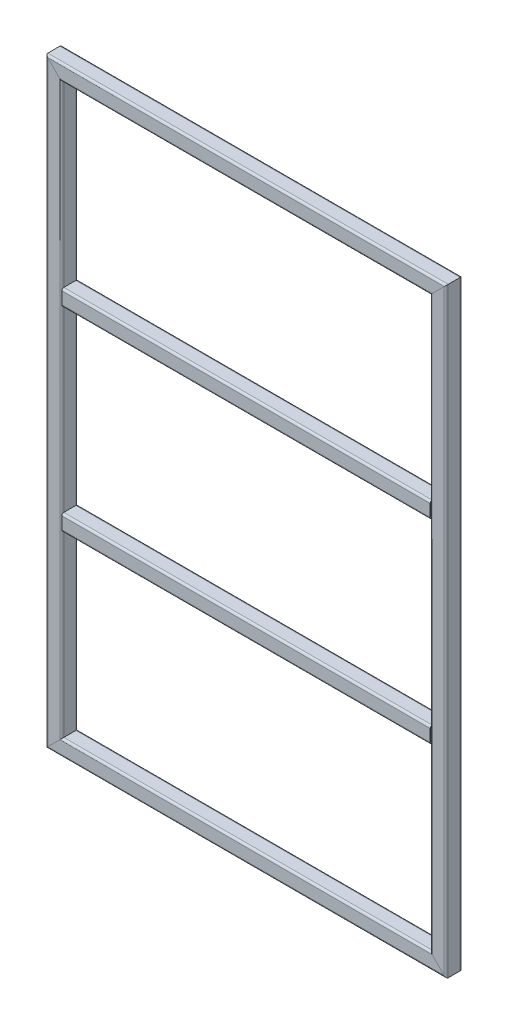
from build123d import *

# Parameters (mm, degrees)
CZ_ON_KONSTRUKCYJNY1_DEPTH      = 2977.568542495
CZ_ON_KONSTRUKCYJNY1_DEPTH_BACK = 57.568542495
CZ_ON_KONSTRUKCYJNY1_2_DEPTH    = 2035.13708499
CZ_ON_KONSTRUKCYJNY1_3_DEPTH    = 3035.13708499
CZ_ON_KONSTRUKCYJNY1_4_DEPTH    = 2035.13708499
CZ_ON_KONSTRUKCYJNY1_5_DEPTH    = 1922
CZ_ON_KONSTRUKCYJNY1_6_DEPTH    = 1922


with BuildPart() as part:
    # Sketch1 → Cz_on konstrukcyjny1 (new, two sides: drawn at the far end of the back side and taken through both)
    with BuildSketch(Plane(origin=(-960, -1460, 0), x_dir=(-1, 0, 0), z_dir=(0, 1, 0)).offset(-CZ_ON_KONSTRUKCYJNY1_DEPTH_BACK)):
        with BuildLine():
            Line((-30, -40), (30, -40))
            ThreePointArc((30, -40), (37.071067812, -37.071067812), (40, -30))
            Line((40, -30), (40, 30))
            ThreePointArc((40, 30), (37.071067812, 37.071067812), (30, 40))
            Line((30, 40), (-30, 40))
            ThreePointArc((-30, 40), (-37.071067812, 37.071067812), (-40, 30))
            Line((-40, 30), (-40, -30))
            ThreePointArc((-40, -30), (-37.071067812, -37.071067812), (-30, -40))
        make_face()
        with BuildLine():
            Line((-30, -35), (30, -35))
            ThreePointArc((30, -35), (33.535533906, -33.535533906), (35, -30))
            Line((35, -30), (35, 30))
            ThreePointArc((35, 30), (33.535533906, 33.535533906), (30, 35))
            Line((30, 35), (-30, 35))
            ThreePointArc((-30, 35), (-33.535533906, 33.535533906), (-35, 30))
            Line((-35, 30), (-35, -30))
            ThreePointArc((-35, -30), (-33.535533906, -33.535533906), (-30, -35))
        make_face(mode=Mode.SUBTRACT)
    extrude(amount=CZ_ON_KONSTRUKCYJNY1_DEPTH + CZ_ON_KONSTRUKCYJNY1_DEPTH_BACK)

    # Cz_on konstrukcyjny1 mitre 1
    split(bisect_by=Plane(origin=(-960, -1460, 0), x_dir=(-0.707106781, -0.707106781, 0), z_dir=(-0.707106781, 0.707106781, 0)), keep=Keep.TOP)

    # Cz_on konstrukcyjny1 mitre 2
    split(bisect_by=Plane(origin=(-960, 1460, 0), x_dir=(0.707106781, -0.707106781, 0), z_dir=(-0.707106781, -0.707106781, 0)), keep=Keep.TOP)


with BuildPart() as body_2:
    # Sketch1 on segment 2 (on carried to segment 2) → Cz_on konstrukcyjny1 2 (new body)
    with BuildSketch(Plane(origin=(-1017.568542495, 1460, 0), x_dir=(0, 1, 0), z_dir=(1, 0, 0))):
        with BuildLine():
            Line((-30, -40), (30, -40))
            ThreePointArc((30, -40), (37.071067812, -37.071067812), (40, -30))
            Line((40, -30), (40, 30))
            ThreePointArc((40, 30), (37.071067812, 37.071067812), (30, 40))
            Line((30, 40), (-30, 40))
            ThreePointArc((-30, 40), (-37.071067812, 37.071067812), (-40, 30))
            Line((-40, 30), (-40, -30))
            ThreePointArc((-40, -30), (-37.071067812, -37.071067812), (-30, -40))
        make_face()
        with BuildLine():
            Line((-30, -35), (30, -35))
            ThreePointArc((30, -35), (33.535533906, -33.535533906), (35, -30))
            Line((35, -30), (35, 30))
            ThreePointArc((35, 30), (33.535533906, 33.535533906), (30, 35))
            Line((30, 35), (-30, 35))
            ThreePointArc((-30, 35), (-33.535533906, 33.535533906), (-35, 30))
            Line((-35, 30), (-35, -30))
            ThreePointArc((-35, -30), (-33.535533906, -33.535533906), (-30, -35))
        make_face(mode=Mode.SUBTRACT)
    extrude(amount=CZ_ON_KONSTRUKCYJNY1_2_DEPTH)

    # Cz_on konstrukcyjny1 2 mitre 1
    split(bisect_by=Plane(origin=(960, 1460, 0), x_dir=(-0.707106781, -0.707106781, 0), z_dir=(-0.707106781, 0.707106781, 0)), keep=Keep.TOP)

    # Cz_on konstrukcyjny1 2 mitre 2
    split(bisect_by=Plane(origin=(-960, 1460, 0), x_dir=(-0.707106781, 0.707106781, 0), z_dir=(0.707106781, 0.707106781, 0)), keep=Keep.TOP)


with BuildPart() as body_3:
    # Sketch1 on segment 3 (on carried to segment 3) → Cz_on konstrukcyjny1 3 (new body)
    with BuildSketch(Plane(origin=(960, 1517.568542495, 0), x_dir=(1, 0, 0), z_dir=(0, -1, 0))):
        with BuildLine():
            Line((-30, -40), (30, -40))
            ThreePointArc((30, -40), (37.071067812, -37.071067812), (40, -30))
            Line((40, -30), (40, 30))
            ThreePointArc((40, 30), (37.071067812, 37.071067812), (30, 40))
            Line((30, 40), (-30, 40))
            ThreePointArc((-30, 40), (-37.071067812, 37.071067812), (-40, 30))
            Line((-40, 30), (-40, -30))
            ThreePointArc((-40, -30), (-37.071067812, -37.071067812), (-30, -40))
        make_face()
        with BuildLine():
            Line((-30, -35), (30, -35))
            ThreePointArc((30, -35), (33.535533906, -33.535533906), (35, -30))
            Line((35, -30), (35, 30))
            ThreePointArc((35, 30), (33.535533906, 33.535533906), (30, 35))
            Line((30, 35), (-30, 35))
            ThreePointArc((-30, 35), (-33.535533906, 33.535533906), (-35, 30))
            Line((-35, 30), (-35, -30))
            ThreePointArc((-35, -30), (-33.535533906, -33.535533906), (-30, -35))
        make_face(mode=Mode.SUBTRACT)
    extrude(amount=CZ_ON_KONSTRUKCYJNY1_3_DEPTH)

    # Cz_on konstrukcyjny1 3 mitre 1
    split(bisect_by=Plane(origin=(960, -1460, 0), x_dir=(-0.707106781, 0.707106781, 0), z_dir=(0.707106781, 0.707106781, 0)), keep=Keep.TOP)

    # Cz_on konstrukcyjny1 3 mitre 2
    split(bisect_by=Plane(origin=(960, 1460, 0), x_dir=(0.707106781, 0.707106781, 0), z_dir=(0.707106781, -0.707106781, 0)), keep=Keep.TOP)


with BuildPart() as body_4:
    # Sketch1 on segment 4 (on carried to segment 4) → Cz_on konstrukcyjny1 4 (new body)
    with BuildSketch(Plane(origin=(1017.568542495, -1460, 0), x_dir=(0, -1, 0), z_dir=(-1, 0, 0))):
        with BuildLine():
            Line((-30, -40), (30, -40))
            ThreePointArc((30, -40), (37.071067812, -37.071067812), (40, -30))
            Line((40, -30), (40, 30))
            ThreePointArc((40, 30), (37.071067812, 37.071067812), (30, 40))
            Line((30, 40), (-30, 40))
            ThreePointArc((-30, 40), (-37.071067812, 37.071067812), (-40, 30))
            Line((-40, 30), (-40, -30))
            ThreePointArc((-40, -30), (-37.071067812, -37.071067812), (-30, -40))
        make_face()
        with BuildLine():
            Line((-30, -35), (30, -35))
            ThreePointArc((30, -35), (33.535533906, -33.535533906), (35, -30))
            Line((35, -30), (35, 30))
            ThreePointArc((35, 30), (33.535533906, 33.535533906), (30, 35))
            Line((30, 35), (-30, 35))
            ThreePointArc((-30, 35), (-33.535533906, 33.535533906), (-35, 30))
            Line((-35, 30), (-35, -30))
            ThreePointArc((-35, -30), (-33.535533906, -33.535533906), (-30, -35))
        make_face(mode=Mode.SUBTRACT)
    extrude(amount=CZ_ON_KONSTRUKCYJNY1_4_DEPTH)

    # Cz_on konstrukcyjny1 4 mitre 1
    split(bisect_by=Plane(origin=(960, -1460, 0), x_dir=(0.707106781, -0.707106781, 0), z_dir=(-0.707106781, -0.707106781, 0)), keep=Keep.TOP)

    # Cz_on konstrukcyjny1 4 mitre 2
    split(bisect_by=Plane(origin=(-960, -1460, 0), x_dir=(0.707106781, 0.707106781, 0), z_dir=(0.707106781, -0.707106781, 0)), keep=Keep.TOP)


with BuildPart() as body_5:
    # Sketch1 on segment 5 (on carried to segment 5) → Cz_on konstrukcyjny1 5 (new body)
    with BuildSketch(Plane(origin=(-961, 486.666666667, 0), x_dir=(0, 1, 0), z_dir=(1, 0, 0))):
        with BuildLine():
            Line((-30, -40), (30, -40))
            ThreePointArc((30, -40), (37.071067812, -37.071067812), (40, -30))
            Line((40, -30), (40, 30))
            ThreePointArc((40, 30), (37.071067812, 37.071067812), (30, 40))
            Line((30, 40), (-30, 40))
            ThreePointArc((-30, 40), (-37.071067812, 37.071067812), (-40, 30))
            Line((-40, 30), (-40, -30))
            ThreePointArc((-40, -30), (-37.071067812, -37.071067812), (-30, -40))
        make_face()
        with BuildLine():
            Line((-30, -35), (30, -35))
            ThreePointArc((30, -35), (33.535533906, -33.535533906), (35, -30))
            Line((35, -30), (35, 30))
            ThreePointArc((35, 30), (33.535533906, 33.535533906), (30, 35))
            Line((30, 35), (-30, 35))
            ThreePointArc((-30, 35), (-33.535533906, 33.535533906), (-35, 30))
            Line((-35, 30), (-35, -30))
            ThreePointArc((-35, -30), (-33.535533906, -33.535533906), (-30, -35))
        make_face(mode=Mode.SUBTRACT)
    extrude(amount=CZ_ON_KONSTRUKCYJNY1_5_DEPTH)

    # Cz_on konstrukcyjny1 5 mitre 1
    split(bisect_by=Plane(origin=(-920, 486.666666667, 0), x_dir=(0, 1, 0), z_dir=(1, 0, 0)), keep=Keep.TOP)

    # Cz_on konstrukcyjny1 5 mitre 2
    split(bisect_by=Plane(origin=(920, 486.666666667, 0), x_dir=(0, -1, 0), z_dir=(-1, 0, 0)), keep=Keep.TOP)


with BuildPart() as body_6:
    # Sketch1 on segment 6 (on carried to segment 6) → Cz_on konstrukcyjny1 6 (new body)
    with BuildSketch(Plane(origin=(-961, -486.666666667, 0), x_dir=(0, 1, 0), z_dir=(1, 0, 0))):
        with BuildLine():
            Line((-30, -40), (30, -40))
            ThreePointArc((30, -40), (37.071067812, -37.071067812), (40, -30))
            Line((40, -30), (40, 30))
            ThreePointArc((40, 30), (37.071067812, 37.071067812), (30, 40))
            Line((30, 40), (-30, 40))
            ThreePointArc((-30, 40), (-37.071067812, 37.071067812), (-40, 30))
            Line((-40, 30), (-40, -30))
            ThreePointArc((-40, -30), (-37.071067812, -37.071067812), (-30, -40))
        make_face()
        with BuildLine():
            Line((-30, -35), (30, -35))
            ThreePointArc((30, -35), (33.535533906, -33.535533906), (35, -30))
            Line((35, -30), (35, 30))
            ThreePointArc((35, 30), (33.535533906, 33.535533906), (30, 35))
            Line((30, 35), (-30, 35))
            ThreePointArc((-30, 35), (-33.535533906, 33.535533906), (-35, 30))
            Line((-35, 30), (-35, -30))
            ThreePointArc((-35, -30), (-33.535533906, -33.535533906), (-30, -35))
        make_face(mode=Mode.SUBTRACT)
    extrude(amount=CZ_ON_KONSTRUKCYJNY1_6_DEPTH)

    # Cz_on konstrukcyjny1 6 mitre 1
    split(bisect_by=Plane(origin=(-920, -486.666666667, 0), x_dir=(0, 1, 0), z_dir=(1, 0, 0)), keep=Keep.TOP)

    # Cz_on konstrukcyjny1 6 mitre 2
    split(bisect_by=Plane(origin=(920, -486.666666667, 0), x_dir=(0, -1, 0), z_dir=(-1, 0, 0)), keep=Keep.TOP)


solid = Compound([part.part, body_2.part, body_3.part, body_4.part, body_5.part, body_6.part])
